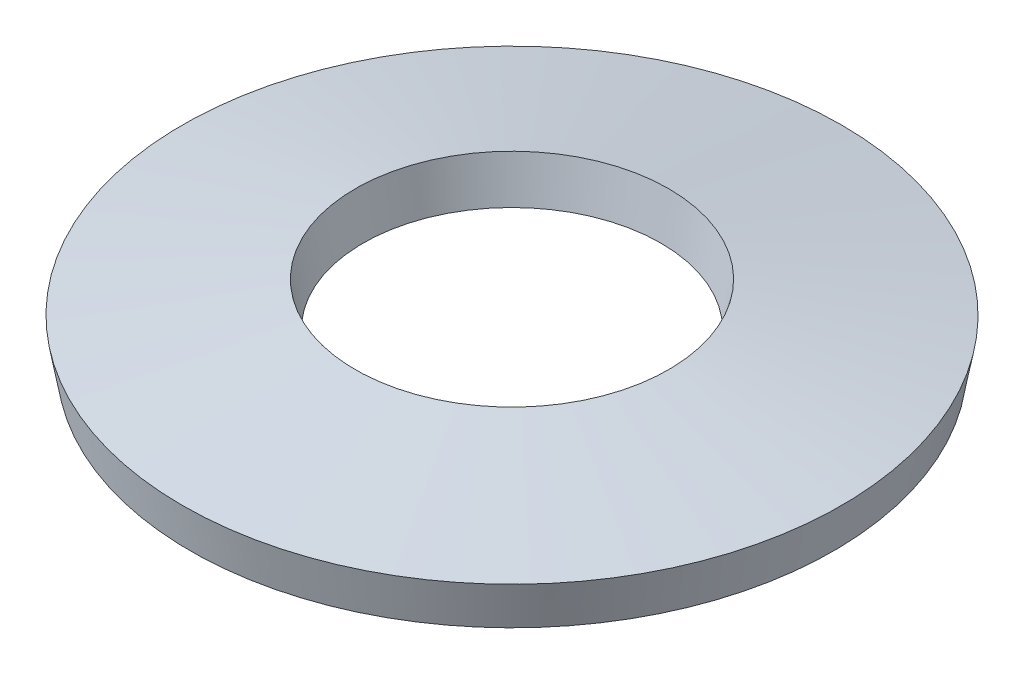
ISO-10303-21;
HEADER;
FILE_DESCRIPTION(('STEP AP214'),'2;1');
FILE_NAME('part.step','',(''),(''),'','','');
FILE_SCHEMA(('AUTOMOTIVE_DESIGN { 1 0 10303 214 1 1 1 1 }'));
ENDSEC;
DATA;
#1=APPLICATION_CONTEXT('core data for automotive mechanical design processes');
#2=APPLICATION_PROTOCOL_DEFINITION('international standard','automotive_design',2000,#1);
#3=PRODUCT_CONTEXT('',#1,'mechanical');
#4=PRODUCT('Part','Part','',(#3));
#5=PRODUCT_RELATED_PRODUCT_CATEGORY('part','',(#4));
#6=PRODUCT_DEFINITION_FORMATION('','',#4);
#7=PRODUCT_DEFINITION_CONTEXT('part definition',#1,'design');
#8=PRODUCT_DEFINITION('design','',#6,#7);
#9=PRODUCT_DEFINITION_SHAPE('','',#8);
#10=(LENGTH_UNIT() NAMED_UNIT(*) SI_UNIT(.MILLI.,.METRE.));
#11=(NAMED_UNIT(*) PLANE_ANGLE_UNIT() SI_UNIT($,.RADIAN.));
#12=(NAMED_UNIT(*) SI_UNIT($,.STERADIAN.) SOLID_ANGLE_UNIT());
#13=UNCERTAINTY_MEASURE_WITH_UNIT(LENGTH_MEASURE(1.E-05),#10,'distance_accuracy_value','');
#14=(GEOMETRIC_REPRESENTATION_CONTEXT(3) GLOBAL_UNCERTAINTY_ASSIGNED_CONTEXT((#13)) GLOBAL_UNIT_ASSIGNED_CONTEXT((#10,
#11,#12)) REPRESENTATION_CONTEXT('',''));
#15=CARTESIAN_POINT('',(0.,0.,0.));
#16=DIRECTION('',(0.,0.,1.));
#17=DIRECTION('',(1.,0.,0.));
#18=AXIS2_PLACEMENT_3D('',#15,#16,#17);
#19=CARTESIAN_POINT('',(0.,1.77134484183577,0.));
#20=DIRECTION('',(0.,-1.,0.));
#21=DIRECTION('',(0.,0.,-1.));
#22=AXIS2_PLACEMENT_3D('',#19,#20,#21);
#23=CONICAL_SURFACE('',#22,13.5,1.39212371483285);
#24=CARTESIAN_POINT('',(0.,3.05,0.));
#25=DIRECTION('',(0.,-1.,0.));
#26=DIRECTION('',(0.,0.,-1.));
#27=AXIS2_PLACEMENT_3D('',#24,#25,#26);
#28=CIRCLE('',#27,6.41990225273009);
#29=CARTESIAN_POINT('',(0.,3.05,-6.41990225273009));
#30=VERTEX_POINT('',#29);
#31=EDGE_CURVE('E10',#30,#30,#28,.T.);
#32=ORIENTED_EDGE('',*,*,#31,.T.);
#33=EDGE_LOOP('',(#32));
#34=FACE_BOUND('',#33,.T.);
#35=CARTESIAN_POINT('',(0.,1.77134484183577,0.));
#36=DIRECTION('',(0.,-1.,0.));
#37=DIRECTION('',(0.,0.,-1.));
#38=AXIS2_PLACEMENT_3D('',#35,#36,#37);
#39=CIRCLE('',#38,13.5);
#40=CARTESIAN_POINT('',(0.,1.77134484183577,-13.5));
#41=VERTEX_POINT('',#40);
#42=EDGE_CURVE('E45',#41,#41,#39,.T.);
#43=ORIENTED_EDGE('',*,*,#42,.F.);
#44=EDGE_LOOP('',(#43));
#45=FACE_BOUND('',#44,.T.);
#46=ADVANCED_FACE('F31',(#34,#45),#23,.T.);
#47=CARTESIAN_POINT('',(0.,3.05,0.));
#48=DIRECTION('',(0.,1.,0.));
#49=DIRECTION('',(0.,0.,1.));
#50=AXIS2_PLACEMENT_3D('',#47,#48,#49);
#51=CONICAL_SURFACE('',#50,6.41990225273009,0.178672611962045);
#52=CARTESIAN_POINT('',(0.,1.27865515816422,0.));
#53=DIRECTION('',(0.,-1.,0.));
#54=DIRECTION('',(0.,0.,-1.));
#55=AXIS2_PLACEMENT_3D('',#52,#53,#54);
#56=CIRCLE('',#55,6.1);
#57=CARTESIAN_POINT('',(0.,1.27865515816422,-6.1));
#58=VERTEX_POINT('',#57);
#59=EDGE_CURVE('E37',#58,#58,#56,.T.);
#60=ORIENTED_EDGE('',*,*,#59,.T.);
#61=EDGE_LOOP('',(#60));
#62=FACE_BOUND('',#61,.T.);
#63=ORIENTED_EDGE('',*,*,#31,.F.);
#64=EDGE_LOOP('',(#63));
#65=FACE_BOUND('',#64,.T.);
#66=ADVANCED_FACE('F55',(#62,#65),#51,.F.);
#67=CARTESIAN_POINT('',(0.,1.27865515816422,0.));
#68=DIRECTION('',(0.,-1.,0.));
#69=DIRECTION('',(0.,0.,-1.));
#70=AXIS2_PLACEMENT_3D('',#67,#68,#69);
#71=CONICAL_SURFACE('',#70,6.1,1.39212371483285);
#72=CARTESIAN_POINT('',(0.,0.,0.));
#73=DIRECTION('',(0.,-1.,0.));
#74=DIRECTION('',(0.,0.,-1.));
#75=AXIS2_PLACEMENT_3D('',#72,#73,#74);
#76=CIRCLE('',#75,13.1800977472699);
#77=CARTESIAN_POINT('',(0.,0.,-13.1800977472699));
#78=VERTEX_POINT('',#77);
#79=EDGE_CURVE('E41',#78,#78,#76,.T.);
#80=ORIENTED_EDGE('',*,*,#79,.T.);
#81=EDGE_LOOP('',(#80));
#82=FACE_BOUND('',#81,.T.);
#83=ORIENTED_EDGE('',*,*,#59,.F.);
#84=EDGE_LOOP('',(#83));
#85=FACE_BOUND('',#84,.T.);
#86=ADVANCED_FACE('F59',(#82,#85),#71,.F.);
#87=CARTESIAN_POINT('',(0.,0.,0.));
#88=DIRECTION('',(0.,1.,0.));
#89=DIRECTION('',(0.,0.,1.));
#90=AXIS2_PLACEMENT_3D('',#87,#88,#89);
#91=CONICAL_SURFACE('',#90,13.1800977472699,0.178672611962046);
#92=ORIENTED_EDGE('',*,*,#42,.T.);
#93=EDGE_LOOP('',(#92));
#94=FACE_BOUND('',#93,.T.);
#95=ORIENTED_EDGE('',*,*,#79,.F.);
#96=EDGE_LOOP('',(#95));
#97=FACE_BOUND('',#96,.T.);
#98=ADVANCED_FACE('F51',(#94,#97),#91,.T.);
#99=CLOSED_SHELL('',(#46,#66,#86,#98));
#100=MANIFOLD_SOLID_BREP('B2',#99);
#101=ADVANCED_BREP_SHAPE_REPRESENTATION('',(#18,#100),#14);
#102=SHAPE_DEFINITION_REPRESENTATION(#9,#101);
ENDSEC;
END-ISO-10303-21;
